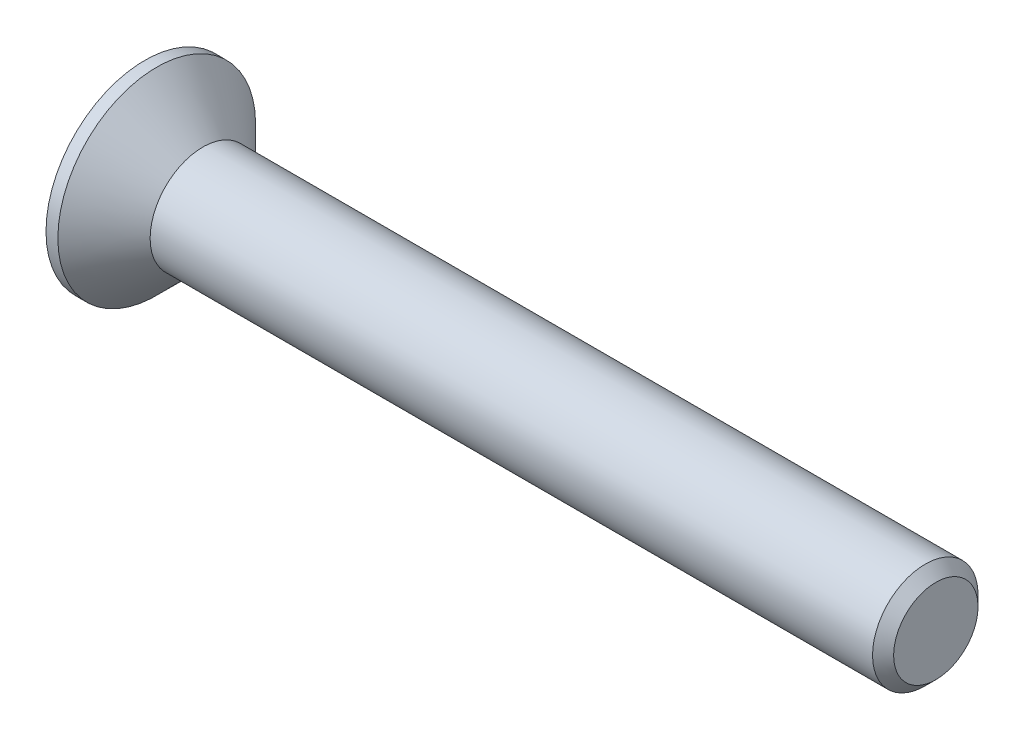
from build123d import *

# Parameters (mm, degrees)
CHAMFER1_SIZE      = 0.4
CUT_EXTRUDE1_DEPTH = 1.9


with BuildPart() as part:
    # Sketch1 → Revolve1 (revolve)
    with BuildSketch(Plane.XY, mode=Mode.PRIVATE) as revolve1_sk:
        Polygon((-2.2, 3.75), (-2.2, 0), (27.8, 0), (27.8, 2), (0, 2), (-1.75, 3.75), align=None)
    revolve(revolve1_sk.sketch.rotate(Axis((-2.2, 0, 0), (1, 0, 0)), 90), axis=Axis((-2.2, 0, 0), (1, 0, 0)))

    # Chamfer1
    chamfer1_edges = [part.edges().sort_by_distance(p)[0] for p in [
        (27.8, 0, -2),
    ]]
    chamfer(chamfer1_edges, length=CHAMFER1_SIZE)

    # Sketch2 → Cut-Extrude1 (cut)
    with BuildSketch(Plane.ZY.offset(2.2)):
        Polygon((-0.55, 2.2), (0.55, 2.2), (0.55, 0.55), (2.2, 0.55), (2.2, -0.55), (0.55, -0.55), (0.55, -2.2), (-0.55, -2.2), (-0.55, -0.55), (-2.2, -0.55), (-2.2, 0.55), (-0.55, 0.55), align=None)
    extrude(amount=-CUT_EXTRUDE1_DEPTH, mode=Mode.SUBTRACT)


solid = part.part
